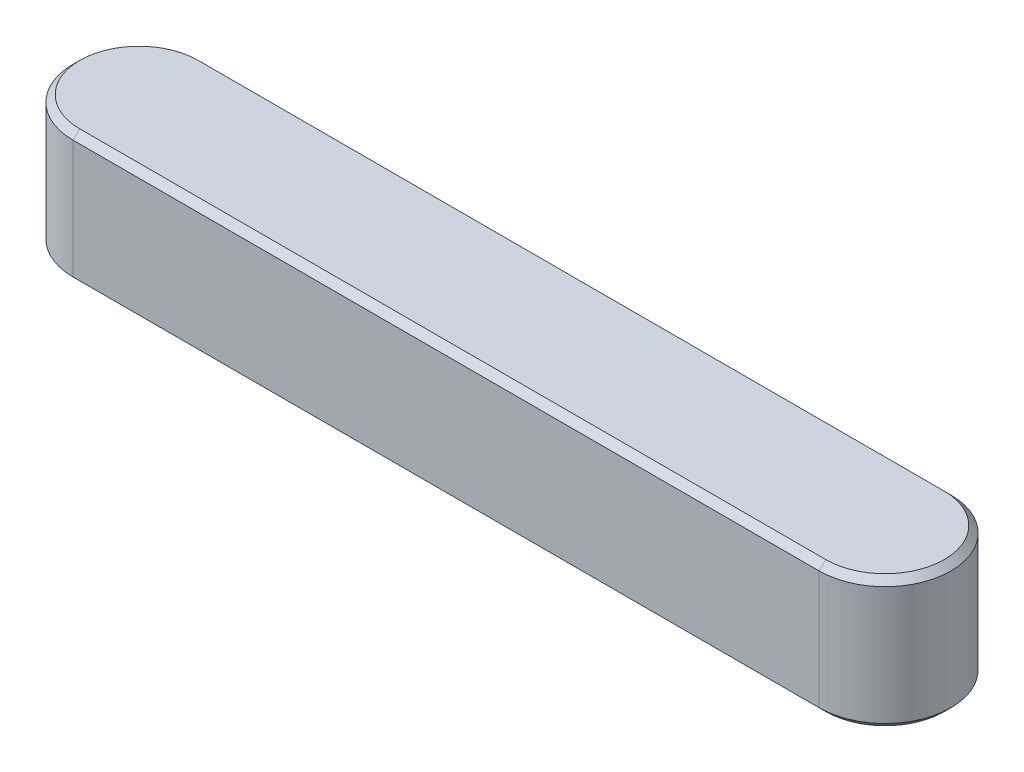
ISO-10303-21;
HEADER;
FILE_DESCRIPTION(('STEP AP214'),'2;1');
FILE_NAME('part.step','',(''),(''),'','','');
FILE_SCHEMA(('AUTOMOTIVE_DESIGN { 1 0 10303 214 1 1 1 1 }'));
ENDSEC;
DATA;
#1=APPLICATION_CONTEXT('core data for automotive mechanical design processes');
#2=APPLICATION_PROTOCOL_DEFINITION('international standard','automotive_design',2000,#1);
#3=PRODUCT_CONTEXT('',#1,'mechanical');
#4=PRODUCT('Part','Part','',(#3));
#5=PRODUCT_RELATED_PRODUCT_CATEGORY('part','',(#4));
#6=PRODUCT_DEFINITION_FORMATION('','',#4);
#7=PRODUCT_DEFINITION_CONTEXT('part definition',#1,'design');
#8=PRODUCT_DEFINITION('design','',#6,#7);
#9=PRODUCT_DEFINITION_SHAPE('','',#8);
#10=(LENGTH_UNIT() NAMED_UNIT(*) SI_UNIT(.MILLI.,.METRE.));
#11=(NAMED_UNIT(*) PLANE_ANGLE_UNIT() SI_UNIT($,.RADIAN.));
#12=(NAMED_UNIT(*) SI_UNIT($,.STERADIAN.) SOLID_ANGLE_UNIT());
#13=UNCERTAINTY_MEASURE_WITH_UNIT(LENGTH_MEASURE(1.E-05),#10,'distance_accuracy_value','');
#14=(GEOMETRIC_REPRESENTATION_CONTEXT(3) GLOBAL_UNCERTAINTY_ASSIGNED_CONTEXT((#13)) GLOBAL_UNIT_ASSIGNED_CONTEXT((#10,
#11,#12)) REPRESENTATION_CONTEXT('',''));
#15=CARTESIAN_POINT('',(0.,0.,0.));
#16=DIRECTION('',(0.,0.,1.));
#17=DIRECTION('',(1.,0.,0.));
#18=AXIS2_PLACEMENT_3D('',#15,#16,#17);
#19=CARTESIAN_POINT('',(-8.5,3.,0.));
#20=DIRECTION('',(0.,-1.,0.));
#21=DIRECTION('',(0.,0.,-1.));
#22=AXIS2_PLACEMENT_3D('',#19,#20,#21);
#23=CYLINDRICAL_SURFACE('',#22,1.5);
#24=DIRECTION('',(0.,-1.,0.));
#25=VECTOR('',#24,1.);
#26=CARTESIAN_POINT('',(-8.5,3.,-1.5));
#27=LINE('',#26,#25);
#28=CARTESIAN_POINT('',(-8.5,2.85,-1.5));
#29=VERTEX_POINT('',#28);
#30=CARTESIAN_POINT('',(-8.5,0.149999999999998,-1.5));
#31=VERTEX_POINT('',#30);
#32=EDGE_CURVE('E153',#29,#31,#27,.T.);
#33=ORIENTED_EDGE('',*,*,#32,.T.);
#34=CARTESIAN_POINT('',(-8.5,0.149999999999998,0.));
#35=DIRECTION('',(0.,1.,0.));
#36=DIRECTION('',(0.,0.,1.));
#37=AXIS2_PLACEMENT_3D('',#34,#35,#36);
#38=CIRCLE('',#37,1.5);
#39=CARTESIAN_POINT('',(-8.5,0.149999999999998,1.5));
#40=VERTEX_POINT('',#39);
#41=EDGE_CURVE('E162',#31,#40,#38,.T.);
#42=ORIENTED_EDGE('',*,*,#41,.T.);
#43=DIRECTION('',(0.,-1.,0.));
#44=VECTOR('',#43,1.);
#45=CARTESIAN_POINT('',(-8.5,3.,1.5));
#46=LINE('',#45,#44);
#47=CARTESIAN_POINT('',(-8.5,2.85,1.5));
#48=VERTEX_POINT('',#47);
#49=EDGE_CURVE('E131',#48,#40,#46,.T.);
#50=ORIENTED_EDGE('',*,*,#49,.F.);
#51=CARTESIAN_POINT('',(-8.5,2.85,0.));
#52=DIRECTION('',(0.,1.,0.));
#53=DIRECTION('',(0.,0.,1.));
#54=AXIS2_PLACEMENT_3D('',#51,#52,#53);
#55=CIRCLE('',#54,1.5);
#56=EDGE_CURVE('E164',#48,#29,#55,.F.);
#57=ORIENTED_EDGE('',*,*,#56,.T.);
#58=EDGE_LOOP('',(#33,#42,#50,#57));
#59=FACE_BOUND('',#58,.T.);
#60=ADVANCED_FACE('F43',(#59),#23,.T.);
#61=CARTESIAN_POINT('',(-8.5,3.,1.5));
#62=DIRECTION('',(0.,0.,-1.));
#63=DIRECTION('',(-1.,0.,0.));
#64=AXIS2_PLACEMENT_3D('',#61,#62,#63);
#65=PLANE('',#64);
#66=ORIENTED_EDGE('',*,*,#49,.T.);
#67=DIRECTION('',(1.,0.,0.));
#68=VECTOR('',#67,1.);
#69=CARTESIAN_POINT('',(-8.5,0.149999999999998,1.5));
#70=LINE('',#69,#68);
#71=CARTESIAN_POINT('',(8.5,0.149999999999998,1.5));
#72=VERTEX_POINT('',#71);
#73=EDGE_CURVE('E130',#40,#72,#70,.T.);
#74=ORIENTED_EDGE('',*,*,#73,.T.);
#75=DIRECTION('',(0.,-1.,0.));
#76=VECTOR('',#75,1.);
#77=CARTESIAN_POINT('',(8.5,3.,1.5));
#78=LINE('',#77,#76);
#79=CARTESIAN_POINT('',(8.5,2.85,1.5));
#80=VERTEX_POINT('',#79);
#81=EDGE_CURVE('E113',#80,#72,#78,.T.);
#82=ORIENTED_EDGE('',*,*,#81,.F.);
#83=DIRECTION('',(-1.,0.,0.));
#84=VECTOR('',#83,1.);
#85=CARTESIAN_POINT('',(-8.5,2.85,1.5));
#86=LINE('',#85,#84);
#87=EDGE_CURVE('E127',#80,#48,#86,.T.);
#88=ORIENTED_EDGE('',*,*,#87,.T.);
#89=EDGE_LOOP('',(#66,#74,#82,#88));
#90=FACE_BOUND('',#89,.T.);
#91=ADVANCED_FACE('F126',(#90),#65,.F.);
#92=CARTESIAN_POINT('',(8.5,3.,0.));
#93=DIRECTION('',(0.,-1.,0.));
#94=DIRECTION('',(0.,0.,-1.));
#95=AXIS2_PLACEMENT_3D('',#92,#93,#94);
#96=CYLINDRICAL_SURFACE('',#95,1.5);
#97=ORIENTED_EDGE('',*,*,#81,.T.);
#98=CARTESIAN_POINT('',(8.5,0.149999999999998,0.));
#99=DIRECTION('',(0.,1.,0.));
#100=DIRECTION('',(0.,0.,1.));
#101=AXIS2_PLACEMENT_3D('',#98,#99,#100);
#102=CIRCLE('',#101,1.5);
#103=CARTESIAN_POINT('',(8.5,0.149999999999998,-1.5));
#104=VERTEX_POINT('',#103);
#105=EDGE_CURVE('E119',#72,#104,#102,.T.);
#106=ORIENTED_EDGE('',*,*,#105,.T.);
#107=DIRECTION('',(0.,-1.,0.));
#108=VECTOR('',#107,1.);
#109=CARTESIAN_POINT('',(8.5,3.,-1.5));
#110=LINE('',#109,#108);
#111=CARTESIAN_POINT('',(8.5,2.85,-1.5));
#112=VERTEX_POINT('',#111);
#113=EDGE_CURVE('E115',#112,#104,#110,.T.);
#114=ORIENTED_EDGE('',*,*,#113,.F.);
#115=CARTESIAN_POINT('',(8.5,2.85,0.));
#116=DIRECTION('',(0.,1.,0.));
#117=DIRECTION('',(0.,0.,1.));
#118=AXIS2_PLACEMENT_3D('',#115,#116,#117);
#119=CIRCLE('',#118,1.5);
#120=EDGE_CURVE('E110',#112,#80,#119,.F.);
#121=ORIENTED_EDGE('',*,*,#120,.T.);
#122=EDGE_LOOP('',(#97,#106,#114,#121));
#123=FACE_BOUND('',#122,.T.);
#124=ADVANCED_FACE('F112',(#123),#96,.T.);
#125=CARTESIAN_POINT('',(-8.5,3.,-1.5));
#126=DIRECTION('',(0.,0.,1.));
#127=DIRECTION('',(1.,0.,0.));
#128=AXIS2_PLACEMENT_3D('',#125,#126,#127);
#129=PLANE('',#128);
#130=ORIENTED_EDGE('',*,*,#113,.T.);
#131=DIRECTION('',(-1.,0.,0.));
#132=VECTOR('',#131,1.);
#133=CARTESIAN_POINT('',(-8.5,0.149999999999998,-1.5));
#134=LINE('',#133,#132);
#135=EDGE_CURVE('E166',#104,#31,#134,.T.);
#136=ORIENTED_EDGE('',*,*,#135,.T.);
#137=ORIENTED_EDGE('',*,*,#32,.F.);
#138=DIRECTION('',(1.,0.,0.));
#139=VECTOR('',#138,1.);
#140=CARTESIAN_POINT('',(8.5,2.85,-1.5));
#141=LINE('',#140,#139);
#142=EDGE_CURVE('E168',#29,#112,#141,.T.);
#143=ORIENTED_EDGE('',*,*,#142,.T.);
#144=EDGE_LOOP('',(#130,#136,#137,#143));
#145=FACE_BOUND('',#144,.T.);
#146=ADVANCED_FACE('F206',(#145),#129,.F.);
#147=CARTESIAN_POINT('',(-8.5,3.,0.));
#148=DIRECTION('',(0.,1.,0.));
#149=DIRECTION('',(0.,0.,1.));
#150=AXIS2_PLACEMENT_3D('',#147,#148,#149);
#151=PLANE('',#150);
#152=CARTESIAN_POINT('',(8.5,3.,0.));
#153=DIRECTION('',(0.,1.,0.));
#154=DIRECTION('',(0.,0.,1.));
#155=AXIS2_PLACEMENT_3D('',#152,#153,#154);
#156=CIRCLE('',#155,1.35);
#157=CARTESIAN_POINT('',(8.5,3.,1.35));
#158=VERTEX_POINT('',#157);
#159=CARTESIAN_POINT('',(8.5,3.,-1.35));
#160=VERTEX_POINT('',#159);
#161=EDGE_CURVE('E53',#158,#160,#156,.T.);
#162=ORIENTED_EDGE('',*,*,#161,.T.);
#163=DIRECTION('',(-1.,0.,0.));
#164=VECTOR('',#163,1.);
#165=CARTESIAN_POINT('',(-8.5,3.,-1.35));
#166=LINE('',#165,#164);
#167=CARTESIAN_POINT('',(-8.5,3.,-1.35));
#168=VERTEX_POINT('',#167);
#169=EDGE_CURVE('E11',#160,#168,#166,.T.);
#170=ORIENTED_EDGE('',*,*,#169,.T.);
#171=CARTESIAN_POINT('',(-8.5,3.,0.));
#172=DIRECTION('',(0.,1.,0.));
#173=DIRECTION('',(0.,0.,1.));
#174=AXIS2_PLACEMENT_3D('',#171,#172,#173);
#175=CIRCLE('',#174,1.35);
#176=CARTESIAN_POINT('',(-8.5,3.,1.35));
#177=VERTEX_POINT('',#176);
#178=EDGE_CURVE('E160',#168,#177,#175,.T.);
#179=ORIENTED_EDGE('',*,*,#178,.T.);
#180=DIRECTION('',(1.,0.,0.));
#181=VECTOR('',#180,1.);
#182=CARTESIAN_POINT('',(8.5,3.,1.35));
#183=LINE('',#182,#181);
#184=EDGE_CURVE('E64',#177,#158,#183,.T.);
#185=ORIENTED_EDGE('',*,*,#184,.T.);
#186=EDGE_LOOP('',(#162,#170,#179,#185));
#187=FACE_BOUND('',#186,.T.);
#188=ADVANCED_FACE('F212',(#187),#151,.T.);
#189=CARTESIAN_POINT('',(-8.5,0.,0.));
#190=DIRECTION('',(0.,1.,0.));
#191=DIRECTION('',(0.,0.,1.));
#192=AXIS2_PLACEMENT_3D('',#189,#190,#191);
#193=PLANE('',#192);
#194=CARTESIAN_POINT('',(8.5,0.,0.));
#195=DIRECTION('',(0.,1.,0.));
#196=DIRECTION('',(0.,0.,1.));
#197=AXIS2_PLACEMENT_3D('',#194,#195,#196);
#198=CIRCLE('',#197,1.35);
#199=CARTESIAN_POINT('',(8.5,0.,-1.35));
#200=VERTEX_POINT('',#199);
#201=CARTESIAN_POINT('',(8.5,0.,1.35));
#202=VERTEX_POINT('',#201);
#203=EDGE_CURVE('E173',#200,#202,#198,.F.);
#204=ORIENTED_EDGE('',*,*,#203,.T.);
#205=DIRECTION('',(-1.,0.,0.));
#206=VECTOR('',#205,1.);
#207=CARTESIAN_POINT('',(-8.5,0.,1.35));
#208=LINE('',#207,#206);
#209=CARTESIAN_POINT('',(-8.5,0.,1.35));
#210=VERTEX_POINT('',#209);
#211=EDGE_CURVE('E120',#202,#210,#208,.T.);
#212=ORIENTED_EDGE('',*,*,#211,.T.);
#213=CARTESIAN_POINT('',(-8.5,0.,0.));
#214=DIRECTION('',(0.,1.,0.));
#215=DIRECTION('',(0.,0.,1.));
#216=AXIS2_PLACEMENT_3D('',#213,#214,#215);
#217=CIRCLE('',#216,1.35);
#218=CARTESIAN_POINT('',(-8.5,0.,-1.35));
#219=VERTEX_POINT('',#218);
#220=EDGE_CURVE('E177',#210,#219,#217,.F.);
#221=ORIENTED_EDGE('',*,*,#220,.T.);
#222=DIRECTION('',(1.,0.,0.));
#223=VECTOR('',#222,1.);
#224=CARTESIAN_POINT('',(-8.5,0.,-1.35));
#225=LINE('',#224,#223);
#226=EDGE_CURVE('E175',#219,#200,#225,.T.);
#227=ORIENTED_EDGE('',*,*,#226,.T.);
#228=EDGE_LOOP('',(#204,#212,#221,#227));
#229=FACE_BOUND('',#228,.T.);
#230=ADVANCED_FACE('F214',(#229),#193,.F.);
#231=CARTESIAN_POINT('',(-8.5,0.149999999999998,-1.5));
#232=DIRECTION('',(0.,0.70710678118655,0.707106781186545));
#233=DIRECTION('',(-1.,0.,0.));
#234=AXIS2_PLACEMENT_3D('',#231,#232,#233);
#235=PLANE('',#234);
#236=DIRECTION('',(0.,0.707106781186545,-0.70710678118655));
#237=VECTOR('',#236,1.);
#238=CARTESIAN_POINT('',(8.5,0.,-1.35));
#239=LINE('',#238,#237);
#240=EDGE_CURVE('E154',#200,#104,#239,.T.);
#241=ORIENTED_EDGE('',*,*,#240,.F.);
#242=ORIENTED_EDGE('',*,*,#226,.F.);
#243=DIRECTION('',(0.,-0.707106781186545,0.70710678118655));
#244=VECTOR('',#243,1.);
#245=CARTESIAN_POINT('',(-8.5,0.149999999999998,-1.5));
#246=LINE('',#245,#244);
#247=EDGE_CURVE('E150',#31,#219,#246,.T.);
#248=ORIENTED_EDGE('',*,*,#247,.F.);
#249=ORIENTED_EDGE('',*,*,#135,.F.);
#250=EDGE_LOOP('',(#241,#242,#248,#249));
#251=FACE_BOUND('',#250,.T.);
#252=ADVANCED_FACE('F193',(#251),#235,.F.);
#253=CARTESIAN_POINT('',(-8.5,0.149999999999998,0.));
#254=DIRECTION('',(0.,1.,0.));
#255=DIRECTION('',(0.,0.,1.));
#256=AXIS2_PLACEMENT_3D('',#253,#254,#255);
#257=CONICAL_SURFACE('',#256,1.5,0.785398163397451);
#258=ORIENTED_EDGE('',*,*,#247,.T.);
#259=ORIENTED_EDGE('',*,*,#220,.F.);
#260=DIRECTION('',(0.,-0.707106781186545,-0.70710678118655));
#261=VECTOR('',#260,1.);
#262=CARTESIAN_POINT('',(-8.5,0.149999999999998,1.5));
#263=LINE('',#262,#261);
#264=EDGE_CURVE('E141',#40,#210,#263,.T.);
#265=ORIENTED_EDGE('',*,*,#264,.F.);
#266=ORIENTED_EDGE('',*,*,#41,.F.);
#267=EDGE_LOOP('',(#258,#259,#265,#266));
#268=FACE_BOUND('',#267,.T.);
#269=ADVANCED_FACE('F197',(#268),#257,.T.);
#270=CARTESIAN_POINT('',(8.5,0.149999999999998,0.));
#271=DIRECTION('',(0.,1.,0.));
#272=DIRECTION('',(0.,0.,1.));
#273=AXIS2_PLACEMENT_3D('',#270,#271,#272);
#274=CONICAL_SURFACE('',#273,1.5,0.785398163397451);
#275=ORIENTED_EDGE('',*,*,#240,.T.);
#276=ORIENTED_EDGE('',*,*,#105,.F.);
#277=DIRECTION('',(0.,0.707106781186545,0.70710678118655));
#278=VECTOR('',#277,1.);
#279=CARTESIAN_POINT('',(8.5,0.,1.35));
#280=LINE('',#279,#278);
#281=EDGE_CURVE('E140',#202,#72,#280,.T.);
#282=ORIENTED_EDGE('',*,*,#281,.F.);
#283=ORIENTED_EDGE('',*,*,#203,.F.);
#284=EDGE_LOOP('',(#275,#276,#282,#283));
#285=FACE_BOUND('',#284,.T.);
#286=ADVANCED_FACE('F205',(#285),#274,.T.);
#287=CARTESIAN_POINT('',(-8.5,0.149999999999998,1.5));
#288=DIRECTION('',(0.,0.70710678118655,-0.707106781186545));
#289=DIRECTION('',(1.,0.,0.));
#290=AXIS2_PLACEMENT_3D('',#287,#288,#289);
#291=PLANE('',#290);
#292=ORIENTED_EDGE('',*,*,#264,.T.);
#293=ORIENTED_EDGE('',*,*,#211,.F.);
#294=ORIENTED_EDGE('',*,*,#281,.T.);
#295=ORIENTED_EDGE('',*,*,#73,.F.);
#296=EDGE_LOOP('',(#292,#293,#294,#295));
#297=FACE_BOUND('',#296,.T.);
#298=ADVANCED_FACE('F200',(#297),#291,.F.);
#299=CARTESIAN_POINT('',(-8.5,3.,1.35));
#300=DIRECTION('',(0.,0.707106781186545,0.70710678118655));
#301=DIRECTION('',(-1.,0.,0.));
#302=AXIS2_PLACEMENT_3D('',#299,#300,#301);
#303=PLANE('',#302);
#304=DIRECTION('',(0.,0.70710678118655,-0.707106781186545));
#305=VECTOR('',#304,1.);
#306=CARTESIAN_POINT('',(-8.5,2.85,1.5));
#307=LINE('',#306,#305);
#308=EDGE_CURVE('E136',#48,#177,#307,.T.);
#309=ORIENTED_EDGE('',*,*,#308,.F.);
#310=ORIENTED_EDGE('',*,*,#87,.F.);
#311=DIRECTION('',(0.,-0.70710678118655,0.707106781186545));
#312=VECTOR('',#311,1.);
#313=CARTESIAN_POINT('',(8.5,3.,1.35));
#314=LINE('',#313,#312);
#315=EDGE_CURVE('E48',#158,#80,#314,.T.);
#316=ORIENTED_EDGE('',*,*,#315,.F.);
#317=ORIENTED_EDGE('',*,*,#184,.F.);
#318=EDGE_LOOP('',(#309,#310,#316,#317));
#319=FACE_BOUND('',#318,.T.);
#320=ADVANCED_FACE('F46',(#319),#303,.T.);
#321=CARTESIAN_POINT('',(8.5,3.,0.));
#322=DIRECTION('',(0.,-1.,0.));
#323=DIRECTION('',(0.,0.,-1.));
#324=AXIS2_PLACEMENT_3D('',#321,#322,#323);
#325=CONICAL_SURFACE('',#324,1.35,0.785398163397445);
#326=ORIENTED_EDGE('',*,*,#315,.T.);
#327=ORIENTED_EDGE('',*,*,#120,.F.);
#328=DIRECTION('',(0.,-0.70710678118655,-0.707106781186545));
#329=VECTOR('',#328,1.);
#330=CARTESIAN_POINT('',(8.5,3.,-1.35));
#331=LINE('',#330,#329);
#332=EDGE_CURVE('E143',#160,#112,#331,.T.);
#333=ORIENTED_EDGE('',*,*,#332,.F.);
#334=ORIENTED_EDGE('',*,*,#161,.F.);
#335=EDGE_LOOP('',(#326,#327,#333,#334));
#336=FACE_BOUND('',#335,.T.);
#337=ADVANCED_FACE('F139',(#336),#325,.T.);
#338=CARTESIAN_POINT('',(-8.5,3.,0.));
#339=DIRECTION('',(0.,-1.,0.));
#340=DIRECTION('',(0.,0.,-1.));
#341=AXIS2_PLACEMENT_3D('',#338,#339,#340);
#342=CONICAL_SURFACE('',#341,1.35,0.785398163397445);
#343=ORIENTED_EDGE('',*,*,#308,.T.);
#344=ORIENTED_EDGE('',*,*,#178,.F.);
#345=DIRECTION('',(0.,0.70710678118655,0.707106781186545));
#346=VECTOR('',#345,1.);
#347=CARTESIAN_POINT('',(-8.5,2.85,-1.5));
#348=LINE('',#347,#346);
#349=EDGE_CURVE('E146',#29,#168,#348,.T.);
#350=ORIENTED_EDGE('',*,*,#349,.F.);
#351=ORIENTED_EDGE('',*,*,#56,.F.);
#352=EDGE_LOOP('',(#343,#344,#350,#351));
#353=FACE_BOUND('',#352,.T.);
#354=ADVANCED_FACE('F211',(#353),#342,.T.);
#355=CARTESIAN_POINT('',(-8.5,3.,-1.35));
#356=DIRECTION('',(0.,0.707106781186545,-0.70710678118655));
#357=DIRECTION('',(1.,0.,0.));
#358=AXIS2_PLACEMENT_3D('',#355,#356,#357);
#359=PLANE('',#358);
#360=ORIENTED_EDGE('',*,*,#332,.T.);
#361=ORIENTED_EDGE('',*,*,#142,.F.);
#362=ORIENTED_EDGE('',*,*,#349,.T.);
#363=ORIENTED_EDGE('',*,*,#169,.F.);
#364=EDGE_LOOP('',(#360,#361,#362,#363));
#365=FACE_BOUND('',#364,.T.);
#366=ADVANCED_FACE('F209',(#365),#359,.T.);
#367=CLOSED_SHELL('',(#60,#91,#124,#146,#188,#230,#252,#269,#286,#298,#320,#337,#354,#366));
#368=MANIFOLD_SOLID_BREP('B2',#367);
#369=ADVANCED_BREP_SHAPE_REPRESENTATION('',(#18,#368),#14);
#370=SHAPE_DEFINITION_REPRESENTATION(#9,#369);
ENDSEC;
END-ISO-10303-21;
